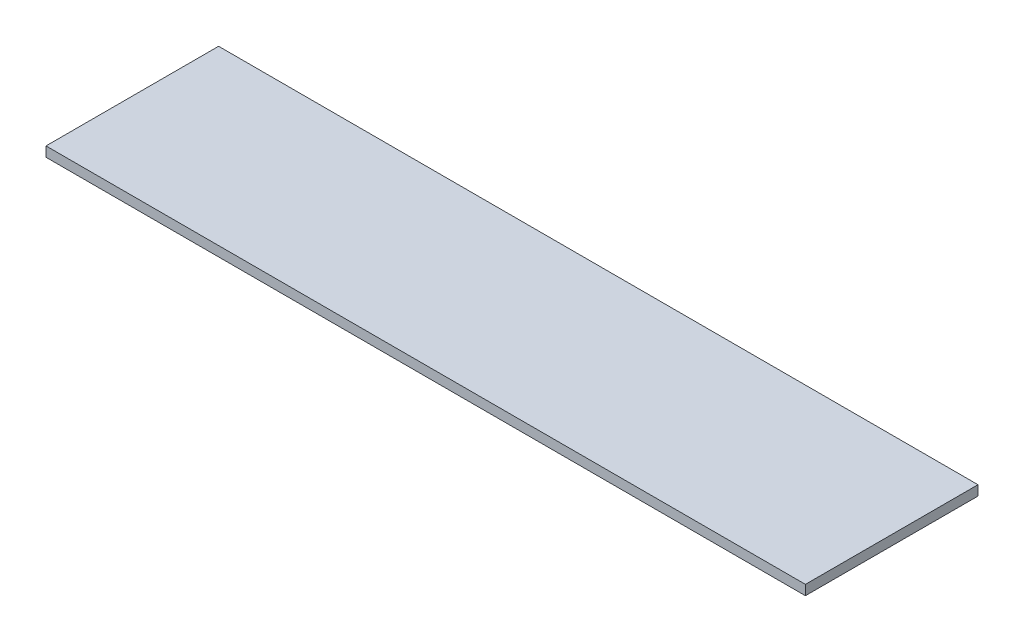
ISO-10303-21;
HEADER;
FILE_DESCRIPTION(('STEP AP214'),'2;1');
FILE_NAME('part.step','',(''),(''),'','','');
FILE_SCHEMA(('AUTOMOTIVE_DESIGN { 1 0 10303 214 1 1 1 1 }'));
ENDSEC;
DATA;
#1=APPLICATION_CONTEXT('core data for automotive mechanical design processes');
#2=APPLICATION_PROTOCOL_DEFINITION('international standard','automotive_design',2000,#1);
#3=PRODUCT_CONTEXT('',#1,'mechanical');
#4=PRODUCT('Part','Part','',(#3));
#5=PRODUCT_RELATED_PRODUCT_CATEGORY('part','',(#4));
#6=PRODUCT_DEFINITION_FORMATION('','',#4);
#7=PRODUCT_DEFINITION_CONTEXT('part definition',#1,'design');
#8=PRODUCT_DEFINITION('design','',#6,#7);
#9=PRODUCT_DEFINITION_SHAPE('','',#8);
#10=(LENGTH_UNIT() NAMED_UNIT(*) SI_UNIT(.MILLI.,.METRE.));
#11=(NAMED_UNIT(*) PLANE_ANGLE_UNIT() SI_UNIT($,.RADIAN.));
#12=(NAMED_UNIT(*) SI_UNIT($,.STERADIAN.) SOLID_ANGLE_UNIT());
#13=UNCERTAINTY_MEASURE_WITH_UNIT(LENGTH_MEASURE(1.E-05),#10,'distance_accuracy_value','');
#14=(GEOMETRIC_REPRESENTATION_CONTEXT(3) GLOBAL_UNCERTAINTY_ASSIGNED_CONTEXT((#13)) GLOBAL_UNIT_ASSIGNED_CONTEXT((#10,
#11,#12)) REPRESENTATION_CONTEXT('',''));
#15=CARTESIAN_POINT('',(0.,0.,0.));
#16=DIRECTION('',(0.,0.,1.));
#17=DIRECTION('',(1.,0.,0.));
#18=AXIS2_PLACEMENT_3D('',#15,#16,#17);
#19=CARTESIAN_POINT('',(770.,10.,175.));
#20=DIRECTION('',(-1.,0.,0.));
#21=DIRECTION('',(0.,0.,1.));
#22=AXIS2_PLACEMENT_3D('',#19,#20,#21);
#23=PLANE('',#22);
#24=DIRECTION('',(0.,0.,-1.));
#25=VECTOR('',#24,1.);
#26=CARTESIAN_POINT('',(770.,-10.,175.));
#27=LINE('',#26,#25);
#28=CARTESIAN_POINT('',(770.,-10.,175.));
#29=VERTEX_POINT('',#28);
#30=CARTESIAN_POINT('',(770.,-10.,-175.));
#31=VERTEX_POINT('',#30);
#32=EDGE_CURVE('E96',#29,#31,#27,.T.);
#33=ORIENTED_EDGE('',*,*,#32,.T.);
#34=DIRECTION('',(0.,-1.,0.));
#35=VECTOR('',#34,1.);
#36=CARTESIAN_POINT('',(770.,10.,-175.));
#37=LINE('',#36,#35);
#38=CARTESIAN_POINT('',(770.,10.,-175.));
#39=VERTEX_POINT('',#38);
#40=EDGE_CURVE('E11',#39,#31,#37,.T.);
#41=ORIENTED_EDGE('',*,*,#40,.F.);
#42=DIRECTION('',(0.,0.,-1.));
#43=VECTOR('',#42,1.);
#44=CARTESIAN_POINT('',(770.,10.,175.));
#45=LINE('',#44,#43);
#46=CARTESIAN_POINT('',(770.,10.,175.));
#47=VERTEX_POINT('',#46);
#48=EDGE_CURVE('E84',#47,#39,#45,.T.);
#49=ORIENTED_EDGE('',*,*,#48,.F.);
#50=DIRECTION('',(0.,-1.,0.));
#51=VECTOR('',#50,1.);
#52=CARTESIAN_POINT('',(770.,10.,175.));
#53=LINE('',#52,#51);
#54=EDGE_CURVE('E92',#47,#29,#53,.T.);
#55=ORIENTED_EDGE('',*,*,#54,.T.);
#56=EDGE_LOOP('',(#33,#41,#49,#55));
#57=FACE_BOUND('',#56,.T.);
#58=ADVANCED_FACE('F33',(#57),#23,.F.);
#59=CARTESIAN_POINT('',(-770.,10.,-175.));
#60=DIRECTION('',(0.,0.,1.));
#61=DIRECTION('',(1.,0.,0.));
#62=AXIS2_PLACEMENT_3D('',#59,#60,#61);
#63=PLANE('',#62);
#64=DIRECTION('',(-1.,0.,0.));
#65=VECTOR('',#64,1.);
#66=CARTESIAN_POINT('',(-770.,-10.,-175.));
#67=LINE('',#66,#65);
#68=CARTESIAN_POINT('',(-770.,-10.,-175.));
#69=VERTEX_POINT('',#68);
#70=EDGE_CURVE('E88',#31,#69,#67,.T.);
#71=ORIENTED_EDGE('',*,*,#70,.T.);
#72=DIRECTION('',(0.,-1.,0.));
#73=VECTOR('',#72,1.);
#74=CARTESIAN_POINT('',(-770.,10.,-175.));
#75=LINE('',#74,#73);
#76=CARTESIAN_POINT('',(-770.,10.,-175.));
#77=VERTEX_POINT('',#76);
#78=EDGE_CURVE('E41',#77,#69,#75,.T.);
#79=ORIENTED_EDGE('',*,*,#78,.F.);
#80=DIRECTION('',(-1.,0.,0.));
#81=VECTOR('',#80,1.);
#82=CARTESIAN_POINT('',(-770.,10.,-175.));
#83=LINE('',#82,#81);
#84=EDGE_CURVE('E79',#39,#77,#83,.T.);
#85=ORIENTED_EDGE('',*,*,#84,.F.);
#86=ORIENTED_EDGE('',*,*,#40,.T.);
#87=EDGE_LOOP('',(#71,#79,#85,#86));
#88=FACE_BOUND('',#87,.T.);
#89=ADVANCED_FACE('F87',(#88),#63,.F.);
#90=CARTESIAN_POINT('',(-770.,10.,175.));
#91=DIRECTION('',(1.,0.,0.));
#92=DIRECTION('',(0.,0.,-1.));
#93=AXIS2_PLACEMENT_3D('',#90,#91,#92);
#94=PLANE('',#93);
#95=DIRECTION('',(0.,0.,1.));
#96=VECTOR('',#95,1.);
#97=CARTESIAN_POINT('',(-770.,-10.,175.));
#98=LINE('',#97,#96);
#99=CARTESIAN_POINT('',(-770.,-10.,175.));
#100=VERTEX_POINT('',#99);
#101=EDGE_CURVE('E66',#69,#100,#98,.T.);
#102=ORIENTED_EDGE('',*,*,#101,.T.);
#103=DIRECTION('',(0.,-1.,0.));
#104=VECTOR('',#103,1.);
#105=CARTESIAN_POINT('',(-770.,10.,175.));
#106=LINE('',#105,#104);
#107=CARTESIAN_POINT('',(-770.,10.,175.));
#108=VERTEX_POINT('',#107);
#109=EDGE_CURVE('E89',#108,#100,#106,.T.);
#110=ORIENTED_EDGE('',*,*,#109,.F.);
#111=DIRECTION('',(0.,0.,1.));
#112=VECTOR('',#111,1.);
#113=CARTESIAN_POINT('',(-770.,10.,175.));
#114=LINE('',#113,#112);
#115=EDGE_CURVE('E82',#77,#108,#114,.T.);
#116=ORIENTED_EDGE('',*,*,#115,.F.);
#117=ORIENTED_EDGE('',*,*,#78,.T.);
#118=EDGE_LOOP('',(#102,#110,#116,#117));
#119=FACE_BOUND('',#118,.T.);
#120=ADVANCED_FACE('F90',(#119),#94,.F.);
#121=CARTESIAN_POINT('',(-770.,10.,175.));
#122=DIRECTION('',(0.,0.,-1.));
#123=DIRECTION('',(-1.,0.,0.));
#124=AXIS2_PLACEMENT_3D('',#121,#122,#123);
#125=PLANE('',#124);
#126=DIRECTION('',(1.,0.,0.));
#127=VECTOR('',#126,1.);
#128=CARTESIAN_POINT('',(-770.,-10.,175.));
#129=LINE('',#128,#127);
#130=EDGE_CURVE('E72',#100,#29,#129,.T.);
#131=ORIENTED_EDGE('',*,*,#130,.T.);
#132=ORIENTED_EDGE('',*,*,#54,.F.);
#133=DIRECTION('',(1.,0.,0.));
#134=VECTOR('',#133,1.);
#135=CARTESIAN_POINT('',(-770.,10.,175.));
#136=LINE('',#135,#134);
#137=EDGE_CURVE('E49',#108,#47,#136,.T.);
#138=ORIENTED_EDGE('',*,*,#137,.F.);
#139=ORIENTED_EDGE('',*,*,#109,.T.);
#140=EDGE_LOOP('',(#131,#132,#138,#139));
#141=FACE_BOUND('',#140,.T.);
#142=ADVANCED_FACE('F103',(#141),#125,.F.);
#143=CARTESIAN_POINT('',(0.,10.,0.));
#144=DIRECTION('',(0.,-1.,0.));
#145=DIRECTION('',(0.,0.,-1.));
#146=AXIS2_PLACEMENT_3D('',#143,#144,#145);
#147=PLANE('',#146);
#148=ORIENTED_EDGE('',*,*,#48,.T.);
#149=ORIENTED_EDGE('',*,*,#84,.T.);
#150=ORIENTED_EDGE('',*,*,#115,.T.);
#151=ORIENTED_EDGE('',*,*,#137,.T.);
#152=EDGE_LOOP('',(#148,#149,#150,#151));
#153=FACE_BOUND('',#152,.T.);
#154=ADVANCED_FACE('F80',(#153),#147,.F.);
#155=CARTESIAN_POINT('',(0.,-10.,0.));
#156=DIRECTION('',(0.,-1.,0.));
#157=DIRECTION('',(0.,0.,-1.));
#158=AXIS2_PLACEMENT_3D('',#155,#156,#157);
#159=PLANE('',#158);
#160=ORIENTED_EDGE('',*,*,#32,.F.);
#161=ORIENTED_EDGE('',*,*,#130,.F.);
#162=ORIENTED_EDGE('',*,*,#101,.F.);
#163=ORIENTED_EDGE('',*,*,#70,.F.);
#164=EDGE_LOOP('',(#160,#161,#162,#163));
#165=FACE_BOUND('',#164,.T.);
#166=ADVANCED_FACE('F106',(#165),#159,.T.);
#167=CLOSED_SHELL('',(#58,#89,#120,#142,#154,#166));
#168=MANIFOLD_SOLID_BREP('B2',#167);
#169=ADVANCED_BREP_SHAPE_REPRESENTATION('',(#18,#168),#14);
#170=SHAPE_DEFINITION_REPRESENTATION(#9,#169);
ENDSEC;
END-ISO-10303-21;
